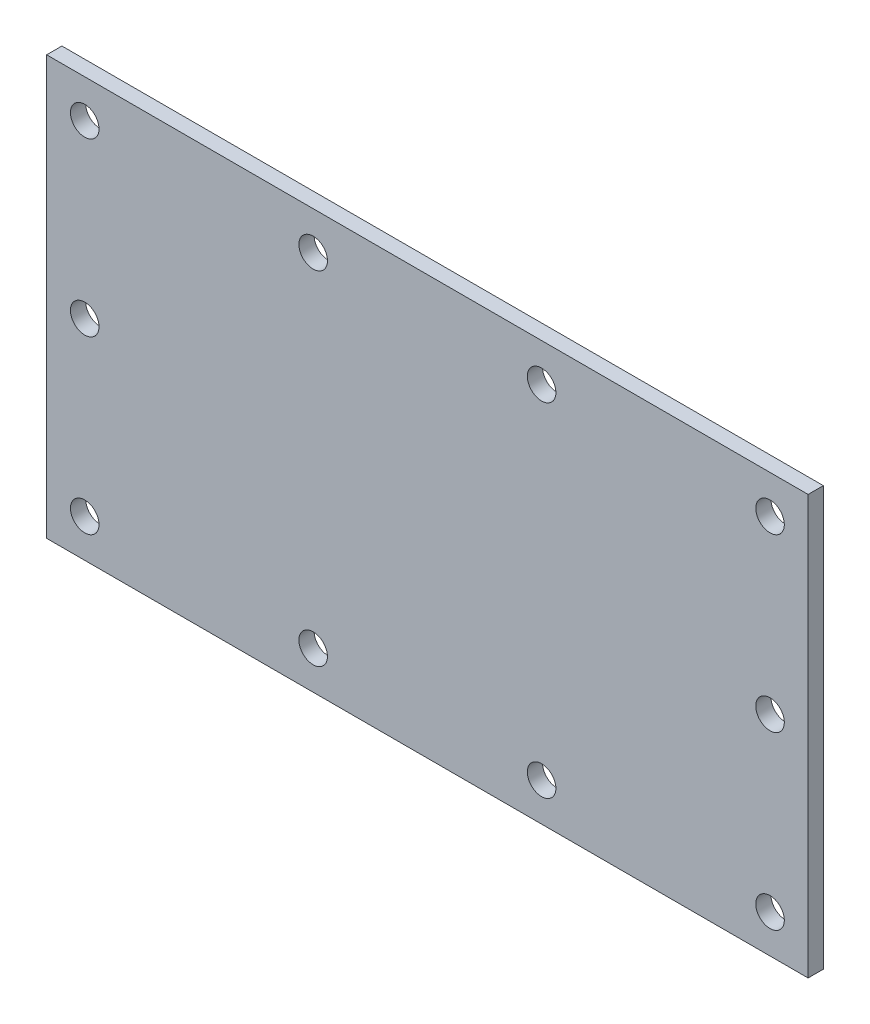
from build123d import *

# Parameters (mm, degrees)
ESQUISSE1_W          = 400
ESQUISSE1_H          = 220
ESQUISSE1_R          = 7.5
BASE_EXTRUSION_DEPTH = 8


with BuildPart() as part:
    # Esquisse1 → Base-Extrusion (new body)
    with BuildSketch(Plane.XY):
        with Locations((200, -110)):
            Rectangle(ESQUISSE1_W, ESQUISSE1_H)
        with Locations((380, -20)):
            Circle(ESQUISSE1_R, mode=Mode.SUBTRACT)
        with Locations((380, -110)):
            Circle(ESQUISSE1_R, mode=Mode.SUBTRACT)
        with Locations((380, -200)):
            Circle(ESQUISSE1_R, mode=Mode.SUBTRACT)
        with Locations((260, -200)):
            Circle(ESQUISSE1_R, mode=Mode.SUBTRACT)
        with Locations((140, -200)):
            Circle(ESQUISSE1_R, mode=Mode.SUBTRACT)
        with Locations((20, -200)):
            Circle(ESQUISSE1_R, mode=Mode.SUBTRACT)
        with Locations((20, -110)):
            Circle(ESQUISSE1_R, mode=Mode.SUBTRACT)
        with Locations((20, -20)):
            Circle(ESQUISSE1_R, mode=Mode.SUBTRACT)
        with Locations((140, -20)):
            Circle(ESQUISSE1_R, mode=Mode.SUBTRACT)
        with Locations((260, -20)):
            Circle(ESQUISSE1_R, mode=Mode.SUBTRACT)
    extrude(amount=BASE_EXTRUSION_DEPTH)


solid = part.part
